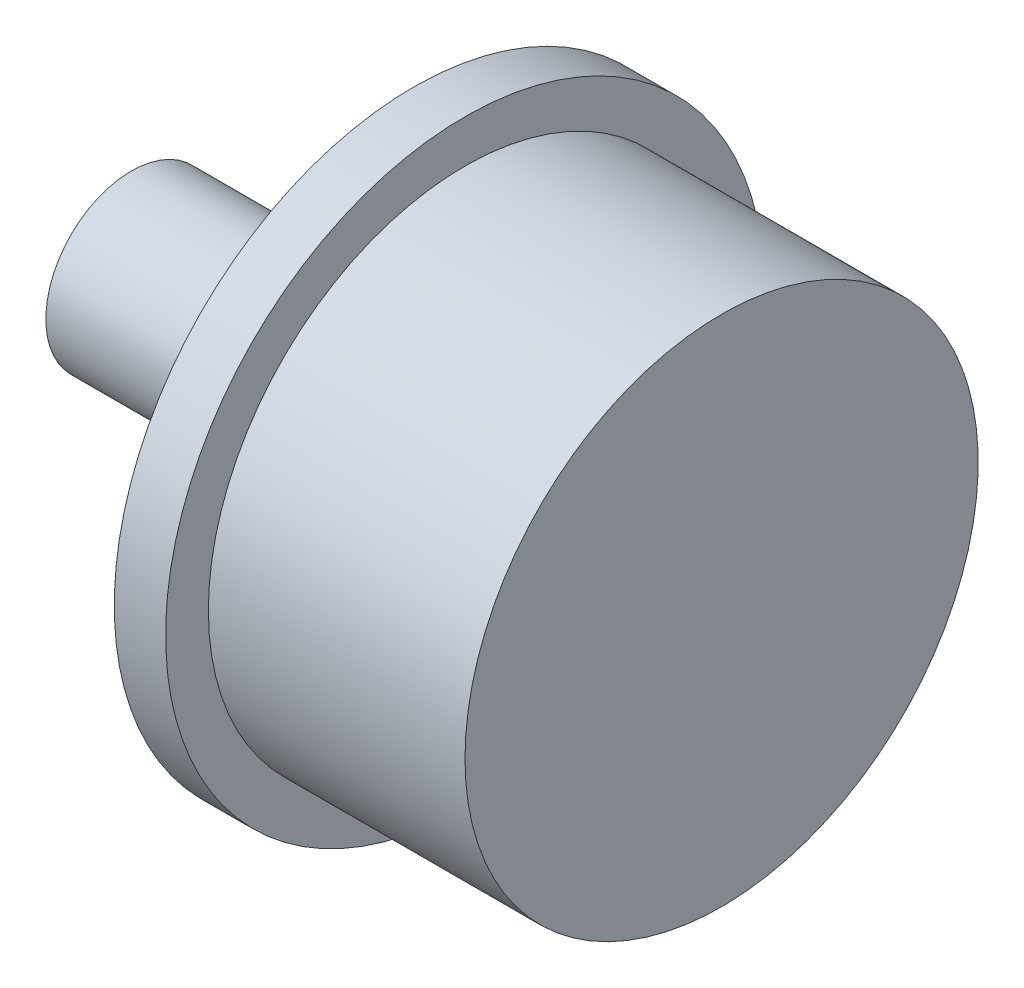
ISO-10303-21;
HEADER;
FILE_DESCRIPTION(('STEP AP214'),'2;1');
FILE_NAME('part.step','',(''),(''),'','','');
FILE_SCHEMA(('AUTOMOTIVE_DESIGN { 1 0 10303 214 1 1 1 1 }'));
ENDSEC;
DATA;
#1=APPLICATION_CONTEXT('core data for automotive mechanical design processes');
#2=APPLICATION_PROTOCOL_DEFINITION('international standard','automotive_design',2000,#1);
#3=PRODUCT_CONTEXT('',#1,'mechanical');
#4=PRODUCT('Part','Part','',(#3));
#5=PRODUCT_RELATED_PRODUCT_CATEGORY('part','',(#4));
#6=PRODUCT_DEFINITION_FORMATION('','',#4);
#7=PRODUCT_DEFINITION_CONTEXT('part definition',#1,'design');
#8=PRODUCT_DEFINITION('design','',#6,#7);
#9=PRODUCT_DEFINITION_SHAPE('','',#8);
#10=(LENGTH_UNIT() NAMED_UNIT(*) SI_UNIT(.MILLI.,.METRE.));
#11=(NAMED_UNIT(*) PLANE_ANGLE_UNIT() SI_UNIT($,.RADIAN.));
#12=(NAMED_UNIT(*) SI_UNIT($,.STERADIAN.) SOLID_ANGLE_UNIT());
#13=UNCERTAINTY_MEASURE_WITH_UNIT(LENGTH_MEASURE(1.E-05),#10,'distance_accuracy_value','');
#14=(GEOMETRIC_REPRESENTATION_CONTEXT(3) GLOBAL_UNCERTAINTY_ASSIGNED_CONTEXT((#13)) GLOBAL_UNIT_ASSIGNED_CONTEXT((#10,
#11,#12)) REPRESENTATION_CONTEXT('',''));
#15=CARTESIAN_POINT('',(0.,0.,0.));
#16=DIRECTION('',(0.,0.,1.));
#17=DIRECTION('',(1.,0.,0.));
#18=AXIS2_PLACEMENT_3D('',#15,#16,#17);
#19=CARTESIAN_POINT('',(-5.715,0.,0.));
#20=DIRECTION('',(-1.,0.,0.));
#21=DIRECTION('',(0.,0.,1.));
#22=AXIS2_PLACEMENT_3D('',#19,#20,#21);
#23=PLANE('',#22);
#24=CARTESIAN_POINT('',(-5.715,0.,0.));
#25=DIRECTION('',(-1.,0.,0.));
#26=DIRECTION('',(0.,0.,1.));
#27=AXIS2_PLACEMENT_3D('',#24,#25,#26);
#28=CIRCLE('',#27,7.62);
#29=CARTESIAN_POINT('',(-5.715,0.,-7.62));
#30=VERTEX_POINT('',#29);
#31=EDGE_CURVE('E54',#30,#30,#28,.T.);
#32=ORIENTED_EDGE('',*,*,#31,.T.);
#33=EDGE_LOOP('',(#32));
#34=FACE_BOUND('',#33,.T.);
#35=CARTESIAN_POINT('',(-5.715,0.,0.));
#36=DIRECTION('',(-1.,0.,0.));
#37=DIRECTION('',(0.,0.,1.));
#38=AXIS2_PLACEMENT_3D('',#35,#36,#37);
#39=CIRCLE('',#38,6.35);
#40=CARTESIAN_POINT('',(-5.715,0.,-6.35));
#41=VERTEX_POINT('',#40);
#42=EDGE_CURVE('E60',#41,#41,#39,.T.);
#43=ORIENTED_EDGE('',*,*,#42,.F.);
#44=EDGE_LOOP('',(#43));
#45=FACE_BOUND('',#44,.T.);
#46=ADVANCED_FACE('F33',(#34,#45),#23,.T.);
#47=CARTESIAN_POINT('',(-3.81,0.,0.));
#48=DIRECTION('',(1.,0.,0.));
#49=DIRECTION('',(0.,0.,-1.));
#50=AXIS2_PLACEMENT_3D('',#47,#48,#49);
#51=PLANE('',#50);
#52=CARTESIAN_POINT('',(-3.81,0.,0.));
#53=DIRECTION('',(1.,0.,0.));
#54=DIRECTION('',(0.,0.,-1.));
#55=AXIS2_PLACEMENT_3D('',#52,#53,#54);
#56=CIRCLE('',#55,22.225);
#57=CARTESIAN_POINT('',(-3.81,0.,-22.225));
#58=VERTEX_POINT('',#57);
#59=EDGE_CURVE('E40',#58,#58,#56,.T.);
#60=ORIENTED_EDGE('',*,*,#59,.F.);
#61=EDGE_LOOP('',(#60));
#62=FACE_BOUND('',#61,.T.);
#63=CARTESIAN_POINT('',(-3.81,0.,0.));
#64=DIRECTION('',(1.,0.,0.));
#65=DIRECTION('',(0.,0.,-1.));
#66=AXIS2_PLACEMENT_3D('',#63,#64,#65);
#67=CIRCLE('',#66,7.62);
#68=CARTESIAN_POINT('',(-3.81,0.,-7.62));
#69=VERTEX_POINT('',#68);
#70=EDGE_CURVE('E10',#69,#69,#67,.F.);
#71=ORIENTED_EDGE('',*,*,#70,.F.);
#72=EDGE_LOOP('',(#71));
#73=FACE_BOUND('',#72,.T.);
#74=ADVANCED_FACE('F76',(#62,#73),#51,.F.);
#75=CARTESIAN_POINT('',(0.,0.,0.));
#76=DIRECTION('',(1.,0.,0.));
#77=DIRECTION('',(0.,0.,-1.));
#78=AXIS2_PLACEMENT_3D('',#75,#76,#77);
#79=PLANE('',#78);
#80=CARTESIAN_POINT('',(0.,0.,0.));
#81=DIRECTION('',(1.,0.,0.));
#82=DIRECTION('',(0.,0.,-1.));
#83=AXIS2_PLACEMENT_3D('',#80,#81,#82);
#84=CIRCLE('',#83,22.225);
#85=CARTESIAN_POINT('',(0.,0.,-22.225));
#86=VERTEX_POINT('',#85);
#87=EDGE_CURVE('E44',#86,#86,#84,.T.);
#88=ORIENTED_EDGE('',*,*,#87,.T.);
#89=EDGE_LOOP('',(#88));
#90=FACE_BOUND('',#89,.T.);
#91=CARTESIAN_POINT('',(0.,0.,0.));
#92=DIRECTION('',(1.,0.,0.));
#93=DIRECTION('',(0.,0.,-1.));
#94=AXIS2_PLACEMENT_3D('',#91,#92,#93);
#95=CIRCLE('',#94,19.05);
#96=CARTESIAN_POINT('',(0.,0.,19.05));
#97=VERTEX_POINT('',#96);
#98=EDGE_CURVE('E51',#97,#97,#95,.T.);
#99=ORIENTED_EDGE('',*,*,#98,.F.);
#100=EDGE_LOOP('',(#99));
#101=FACE_BOUND('',#100,.T.);
#102=ADVANCED_FACE('F82',(#90,#101),#79,.T.);
#103=CARTESIAN_POINT('',(-3.81,0.,0.));
#104=DIRECTION('',(1.,0.,0.));
#105=DIRECTION('',(0.,0.,-1.));
#106=AXIS2_PLACEMENT_3D('',#103,#104,#105);
#107=CYLINDRICAL_SURFACE('',#106,22.225);
#108=CARTESIAN_POINT('',(-3.81,0.,-22.225));
#109=CARTESIAN_POINT('',(-3.7703125,0.,-22.225));
#110=CARTESIAN_POINT('',(-3.730625,0.,-22.225));
#111=CARTESIAN_POINT('',(-3.65125,0.,-22.225));
#112=CARTESIAN_POINT('',(-3.6115625,0.,-22.225));
#113=CARTESIAN_POINT('',(-3.5321875,0.,-22.225));
#114=CARTESIAN_POINT('',(-3.4925,0.,-22.225));
#115=CARTESIAN_POINT('',(-3.413125,0.,-22.225));
#116=CARTESIAN_POINT('',(-3.3734375,0.,-22.225));
#117=CARTESIAN_POINT('',(-3.2940625,0.,-22.225));
#118=CARTESIAN_POINT('',(-3.254375,0.,-22.225));
#119=CARTESIAN_POINT('',(-3.175,0.,-22.225));
#120=CARTESIAN_POINT('',(-3.1353125,0.,-22.225));
#121=CARTESIAN_POINT('',(-3.0559375,0.,-22.225));
#122=CARTESIAN_POINT('',(-3.01625,0.,-22.225));
#123=CARTESIAN_POINT('',(-2.936875,0.,-22.225));
#124=CARTESIAN_POINT('',(-2.8971875,0.,-22.225));
#125=CARTESIAN_POINT('',(-2.8178125,0.,-22.225));
#126=CARTESIAN_POINT('',(-2.778125,0.,-22.225));
#127=CARTESIAN_POINT('',(-2.69875,0.,-22.225));
#128=CARTESIAN_POINT('',(-2.6590625,0.,-22.225));
#129=CARTESIAN_POINT('',(-2.5796875,0.,-22.225));
#130=CARTESIAN_POINT('',(-2.54,0.,-22.225));
#131=CARTESIAN_POINT('',(-2.460625,0.,-22.225));
#132=CARTESIAN_POINT('',(-2.4209375,0.,-22.225));
#133=CARTESIAN_POINT('',(-2.3415625,0.,-22.225));
#134=CARTESIAN_POINT('',(-2.301875,0.,-22.225));
#135=CARTESIAN_POINT('',(-2.2225,0.,-22.225));
#136=CARTESIAN_POINT('',(-2.1828125,0.,-22.225));
#137=CARTESIAN_POINT('',(-2.1034375,0.,-22.225));
#138=CARTESIAN_POINT('',(-2.06375,0.,-22.225));
#139=CARTESIAN_POINT('',(-1.984375,0.,-22.225));
#140=CARTESIAN_POINT('',(-1.9446875,0.,-22.225));
#141=CARTESIAN_POINT('',(-1.8653125,0.,-22.225));
#142=CARTESIAN_POINT('',(-1.825625,0.,-22.225));
#143=CARTESIAN_POINT('',(-1.74625,0.,-22.225));
#144=CARTESIAN_POINT('',(-1.7065625,0.,-22.225));
#145=CARTESIAN_POINT('',(-1.6271875,0.,-22.225));
#146=CARTESIAN_POINT('',(-1.5875,0.,-22.225));
#147=CARTESIAN_POINT('',(-1.508125,0.,-22.225));
#148=CARTESIAN_POINT('',(-1.4684375,0.,-22.225));
#149=CARTESIAN_POINT('',(-1.3890625,0.,-22.225));
#150=CARTESIAN_POINT('',(-1.349375,0.,-22.225));
#151=CARTESIAN_POINT('',(-1.27,0.,-22.225));
#152=CARTESIAN_POINT('',(-1.2303125,0.,-22.225));
#153=CARTESIAN_POINT('',(-1.1509375,0.,-22.225));
#154=CARTESIAN_POINT('',(-1.11125,0.,-22.225));
#155=CARTESIAN_POINT('',(-1.031875,0.,-22.225));
#156=CARTESIAN_POINT('',(-0.9921875,0.,-22.225));
#157=CARTESIAN_POINT('',(-0.9128125,0.,-22.225));
#158=CARTESIAN_POINT('',(-0.873125,0.,-22.225));
#159=CARTESIAN_POINT('',(-0.79375,0.,-22.225));
#160=CARTESIAN_POINT('',(-0.7540625,0.,-22.225));
#161=CARTESIAN_POINT('',(-0.6746875,0.,-22.225));
#162=CARTESIAN_POINT('',(-0.635,0.,-22.225));
#163=CARTESIAN_POINT('',(-0.555625,0.,-22.225));
#164=CARTESIAN_POINT('',(-0.5159375,0.,-22.225));
#165=CARTESIAN_POINT('',(-0.4365625,0.,-22.225));
#166=CARTESIAN_POINT('',(-0.396875,0.,-22.225));
#167=CARTESIAN_POINT('',(-0.3175,0.,-22.225));
#168=CARTESIAN_POINT('',(-0.2778125,0.,-22.225));
#169=CARTESIAN_POINT('',(-0.1984375,0.,-22.225));
#170=CARTESIAN_POINT('',(-0.15875,0.,-22.225));
#171=CARTESIAN_POINT('',(-0.0793749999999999,0.,-22.225));
#172=CARTESIAN_POINT('',(-0.0396874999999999,0.,-22.225));
#173=CARTESIAN_POINT('',(0.,0.,-22.225));
#174=B_SPLINE_CURVE_WITH_KNOTS('',3,(#108,#109,#110,#111,#112,#113,#114,#115,#116,#117,#118,
#119,#120,#121,#122,#123,#124,#125,#126,#127,#128,#129,#130,#131,#132,#133,#134,#135,#136,#137,
#138,#139,#140,#141,#142,#143,#144,#145,#146,#147,#148,#149,#150,#151,#152,#153,#154,#155,#156,
#157,#158,#159,#160,#161,#162,#163,#164,#165,#166,#167,#168,#169,#170,#171,#172,#173),
.UNSPECIFIED.,.F.,.F.,(4,2,2,2,2,2,2,2,2,2,2,2,2,2,2,2,2,2,2,2,2,2,2,2,2,2,2,2,2,2,2,2,4),(0.,
0.1190625,0.238125,0.3571875,0.47625,0.5953125,0.714375,0.833437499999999,0.9525,1.0715625,
1.190625,1.3096875,1.42875,1.5478125,1.666875,1.7859375,1.905,2.0240625,2.143125,2.2621875,
2.38125,2.5003125,2.619375,2.7384375,2.8575,2.9765625,3.095625,3.2146875,3.33375,3.4528125,
3.571875,3.6909375,3.81),.UNSPECIFIED.);
#175=EDGE_CURVE('BSEAM35',#58,#86,#174,.T.);
#176=ORIENTED_EDGE('',*,*,#59,.T.);
#177=ORIENTED_EDGE('',*,*,#87,.F.);
#178=ORIENTED_EDGE('',*,*,#175,.T.);
#179=ORIENTED_EDGE('',*,*,#175,.F.);
#180=EDGE_LOOP('',(#176,#178,#177,#179));
#181=FACE_BOUND('',#180,.T.);
#182=ADVANCED_FACE('F35',(#181),#107,.T.);
#183=CARTESIAN_POINT('',(19.05,0.,0.));
#184=DIRECTION('',(-1.,0.,0.));
#185=DIRECTION('',(0.,0.,1.));
#186=AXIS2_PLACEMENT_3D('',#183,#184,#185);
#187=CYLINDRICAL_SURFACE('',#186,19.05);
#188=CARTESIAN_POINT('',(19.05,0.,0.));
#189=DIRECTION('',(1.,0.,0.));
#190=DIRECTION('',(0.,0.,-1.));
#191=AXIS2_PLACEMENT_3D('',#188,#189,#190);
#192=CIRCLE('',#191,19.05);
#193=CARTESIAN_POINT('',(19.05,0.,19.05));
#194=VERTEX_POINT('',#193);
#195=EDGE_CURVE('E49',#194,#194,#192,.T.);
#196=CARTESIAN_POINT('',(19.05,0.,19.05));
#197=CARTESIAN_POINT('',(18.8515625,0.,19.05));
#198=CARTESIAN_POINT('',(18.653125,0.,19.05));
#199=CARTESIAN_POINT('',(18.25625,0.,19.05));
#200=CARTESIAN_POINT('',(18.0578125,0.,19.05));
#201=CARTESIAN_POINT('',(17.6609375,0.,19.05));
#202=CARTESIAN_POINT('',(17.4625,0.,19.05));
#203=CARTESIAN_POINT('',(17.065625,0.,19.05));
#204=CARTESIAN_POINT('',(16.8671875,0.,19.05));
#205=CARTESIAN_POINT('',(16.4703125,0.,19.05));
#206=CARTESIAN_POINT('',(16.271875,0.,19.05));
#207=CARTESIAN_POINT('',(15.875,0.,19.05));
#208=CARTESIAN_POINT('',(15.6765625,0.,19.05));
#209=CARTESIAN_POINT('',(15.2796875,0.,19.05));
#210=CARTESIAN_POINT('',(15.08125,0.,19.05));
#211=CARTESIAN_POINT('',(14.684375,0.,19.05));
#212=CARTESIAN_POINT('',(14.4859375,0.,19.05));
#213=CARTESIAN_POINT('',(14.0890625,0.,19.05));
#214=CARTESIAN_POINT('',(13.890625,0.,19.05));
#215=CARTESIAN_POINT('',(13.49375,0.,19.05));
#216=CARTESIAN_POINT('',(13.2953125,0.,19.05));
#217=CARTESIAN_POINT('',(12.8984375,0.,19.05));
#218=CARTESIAN_POINT('',(12.7,0.,19.05));
#219=CARTESIAN_POINT('',(12.303125,0.,19.05));
#220=CARTESIAN_POINT('',(12.1046875,0.,19.05));
#221=CARTESIAN_POINT('',(11.7078125,0.,19.05));
#222=CARTESIAN_POINT('',(11.509375,0.,19.05));
#223=CARTESIAN_POINT('',(11.1125,0.,19.05));
#224=CARTESIAN_POINT('',(10.9140625,0.,19.05));
#225=CARTESIAN_POINT('',(10.5171875,0.,19.05));
#226=CARTESIAN_POINT('',(10.31875,0.,19.05));
#227=CARTESIAN_POINT('',(9.921875,0.,19.05));
#228=CARTESIAN_POINT('',(9.7234375,0.,19.05));
#229=CARTESIAN_POINT('',(9.3265625,0.,19.05));
#230=CARTESIAN_POINT('',(9.128125,0.,19.05));
#231=CARTESIAN_POINT('',(8.73125,0.,19.05));
#232=CARTESIAN_POINT('',(8.5328125,0.,19.05));
#233=CARTESIAN_POINT('',(8.1359375,0.,19.05));
#234=CARTESIAN_POINT('',(7.9375,0.,19.05));
#235=CARTESIAN_POINT('',(7.540625,0.,19.05));
#236=CARTESIAN_POINT('',(7.3421875,0.,19.05));
#237=CARTESIAN_POINT('',(6.9453125,0.,19.05));
#238=CARTESIAN_POINT('',(6.746875,0.,19.05));
#239=CARTESIAN_POINT('',(6.35,0.,19.05));
#240=CARTESIAN_POINT('',(6.1515625,0.,19.05));
#241=CARTESIAN_POINT('',(5.7546875,0.,19.05));
#242=CARTESIAN_POINT('',(5.55625,0.,19.05));
#243=CARTESIAN_POINT('',(5.159375,0.,19.05));
#244=CARTESIAN_POINT('',(4.9609375,0.,19.05));
#245=CARTESIAN_POINT('',(4.5640625,0.,19.05));
#246=CARTESIAN_POINT('',(4.365625,0.,19.05));
#247=CARTESIAN_POINT('',(3.96875,0.,19.05));
#248=CARTESIAN_POINT('',(3.7703125,0.,19.05));
#249=CARTESIAN_POINT('',(3.3734375,0.,19.05));
#250=CARTESIAN_POINT('',(3.175,0.,19.05));
#251=CARTESIAN_POINT('',(2.778125,0.,19.05));
#252=CARTESIAN_POINT('',(2.5796875,0.,19.05));
#253=CARTESIAN_POINT('',(2.1828125,0.,19.05));
#254=CARTESIAN_POINT('',(1.984375,0.,19.05));
#255=CARTESIAN_POINT('',(1.5875,0.,19.05));
#256=CARTESIAN_POINT('',(1.3890625,0.,19.05));
#257=CARTESIAN_POINT('',(0.992187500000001,0.,19.05));
#258=CARTESIAN_POINT('',(0.793750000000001,0.,19.05));
#259=CARTESIAN_POINT('',(0.396875,0.,19.05));
#260=CARTESIAN_POINT('',(0.1984375,0.,19.05));
#261=CARTESIAN_POINT('',(0.,0.,19.05));
#262=B_SPLINE_CURVE_WITH_KNOTS('',3,(#196,#197,#198,#199,#200,#201,#202,#203,#204,#205,#206,
#207,#208,#209,#210,#211,#212,#213,#214,#215,#216,#217,#218,#219,#220,#221,#222,#223,#224,#225,
#226,#227,#228,#229,#230,#231,#232,#233,#234,#235,#236,#237,#238,#239,#240,#241,#242,#243,#244,
#245,#246,#247,#248,#249,#250,#251,#252,#253,#254,#255,#256,#257,#258,#259,#260,#261),
.UNSPECIFIED.,.F.,.F.,(4,2,2,2,2,2,2,2,2,2,2,2,2,2,2,2,2,2,2,2,2,2,2,2,2,2,2,2,2,2,2,2,4),(0.,
0.5953125,1.190625,1.7859375,2.38125,2.9765625,3.571875,4.1671875,4.7625,5.3578125,5.953125,
6.5484375,7.14375,7.7390625,8.334375,8.9296875,9.525,10.1203125,10.715625,11.3109375,11.90625,
12.5015625,13.096875,13.6921875,14.2875,14.8828125,15.478125,16.0734375,16.66875,17.2640625,
17.859375,18.4546875,19.05),.UNSPECIFIED.);
#263=EDGE_CURVE('BSEAM93',#194,#97,#262,.T.);
#264=ORIENTED_EDGE('',*,*,#195,.F.);
#265=ORIENTED_EDGE('',*,*,#98,.T.);
#266=ORIENTED_EDGE('',*,*,#263,.T.);
#267=ORIENTED_EDGE('',*,*,#263,.F.);
#268=EDGE_LOOP('',(#264,#266,#265,#267));
#269=FACE_BOUND('',#268,.T.);
#270=ADVANCED_FACE('F93',(#269),#187,.T.);
#271=CARTESIAN_POINT('',(19.05,0.,0.));
#272=DIRECTION('',(1.,0.,0.));
#273=DIRECTION('',(0.,0.,-1.));
#274=AXIS2_PLACEMENT_3D('',#271,#272,#273);
#275=PLANE('',#274);
#276=ORIENTED_EDGE('',*,*,#195,.T.);
#277=EDGE_LOOP('',(#276));
#278=FACE_BOUND('',#277,.T.);
#279=ADVANCED_FACE('F89',(#278),#275,.T.);
#280=CARTESIAN_POINT('',(-5.715,0.,0.));
#281=DIRECTION('',(1.,0.,0.));
#282=DIRECTION('',(0.,0.,-1.));
#283=AXIS2_PLACEMENT_3D('',#280,#281,#282);
#284=CYLINDRICAL_SURFACE('',#283,7.62);
#285=CARTESIAN_POINT('',(-5.715,0.,-7.62));
#286=CARTESIAN_POINT('',(-5.69515625,0.,-7.62));
#287=CARTESIAN_POINT('',(-5.6753125,0.,-7.62));
#288=CARTESIAN_POINT('',(-5.635625,0.,-7.62));
#289=CARTESIAN_POINT('',(-5.61578125,0.,-7.62));
#290=CARTESIAN_POINT('',(-5.57609375,0.,-7.62));
#291=CARTESIAN_POINT('',(-5.55625,0.,-7.62));
#292=CARTESIAN_POINT('',(-5.5165625,0.,-7.62));
#293=CARTESIAN_POINT('',(-5.49671875,0.,-7.62));
#294=CARTESIAN_POINT('',(-5.45703125,0.,-7.62));
#295=CARTESIAN_POINT('',(-5.4371875,0.,-7.62));
#296=CARTESIAN_POINT('',(-5.3975,0.,-7.62));
#297=CARTESIAN_POINT('',(-5.37765625,0.,-7.62));
#298=CARTESIAN_POINT('',(-5.33796875,0.,-7.62));
#299=CARTESIAN_POINT('',(-5.318125,0.,-7.62));
#300=CARTESIAN_POINT('',(-5.2784375,0.,-7.62));
#301=CARTESIAN_POINT('',(-5.25859375,0.,-7.62));
#302=CARTESIAN_POINT('',(-5.21890625,0.,-7.62));
#303=CARTESIAN_POINT('',(-5.1990625,0.,-7.62));
#304=CARTESIAN_POINT('',(-5.159375,0.,-7.62));
#305=CARTESIAN_POINT('',(-5.13953125,0.,-7.62));
#306=CARTESIAN_POINT('',(-5.09984375,0.,-7.62));
#307=CARTESIAN_POINT('',(-5.08,0.,-7.62));
#308=CARTESIAN_POINT('',(-5.0403125,0.,-7.62));
#309=CARTESIAN_POINT('',(-5.02046875,0.,-7.62));
#310=CARTESIAN_POINT('',(-4.98078125,0.,-7.62));
#311=CARTESIAN_POINT('',(-4.9609375,0.,-7.62));
#312=CARTESIAN_POINT('',(-4.92125,0.,-7.62));
#313=CARTESIAN_POINT('',(-4.90140625,0.,-7.62));
#314=CARTESIAN_POINT('',(-4.86171875,0.,-7.62));
#315=CARTESIAN_POINT('',(-4.841875,0.,-7.62));
#316=CARTESIAN_POINT('',(-4.8021875,0.,-7.62));
#317=CARTESIAN_POINT('',(-4.78234375,0.,-7.62));
#318=CARTESIAN_POINT('',(-4.74265625,0.,-7.62));
#319=CARTESIAN_POINT('',(-4.7228125,0.,-7.62));
#320=CARTESIAN_POINT('',(-4.683125,0.,-7.62));
#321=CARTESIAN_POINT('',(-4.66328125,0.,-7.62));
#322=CARTESIAN_POINT('',(-4.62359375,0.,-7.62));
#323=CARTESIAN_POINT('',(-4.60375,0.,-7.62));
#324=CARTESIAN_POINT('',(-4.5640625,0.,-7.62));
#325=CARTESIAN_POINT('',(-4.54421875,0.,-7.62));
#326=CARTESIAN_POINT('',(-4.50453125,0.,-7.62));
#327=CARTESIAN_POINT('',(-4.4846875,0.,-7.62));
#328=CARTESIAN_POINT('',(-4.445,0.,-7.62));
#329=CARTESIAN_POINT('',(-4.42515625,0.,-7.62));
#330=CARTESIAN_POINT('',(-4.38546875,0.,-7.62));
#331=CARTESIAN_POINT('',(-4.365625,0.,-7.62));
#332=CARTESIAN_POINT('',(-4.3259375,0.,-7.62));
#333=CARTESIAN_POINT('',(-4.30609375,0.,-7.62));
#334=CARTESIAN_POINT('',(-4.26640625,0.,-7.62));
#335=CARTESIAN_POINT('',(-4.2465625,0.,-7.62));
#336=CARTESIAN_POINT('',(-4.206875,0.,-7.62));
#337=CARTESIAN_POINT('',(-4.18703125,0.,-7.62));
#338=CARTESIAN_POINT('',(-4.14734375,0.,-7.62));
#339=CARTESIAN_POINT('',(-4.1275,0.,-7.62));
#340=CARTESIAN_POINT('',(-4.0878125,0.,-7.62));
#341=CARTESIAN_POINT('',(-4.06796875,0.,-7.62));
#342=CARTESIAN_POINT('',(-4.02828125,0.,-7.62));
#343=CARTESIAN_POINT('',(-4.0084375,0.,-7.62));
#344=CARTESIAN_POINT('',(-3.96875,0.,-7.62));
#345=CARTESIAN_POINT('',(-3.94890625,0.,-7.62));
#346=CARTESIAN_POINT('',(-3.90921875,0.,-7.62));
#347=CARTESIAN_POINT('',(-3.889375,0.,-7.62));
#348=CARTESIAN_POINT('',(-3.8496875,0.,-7.62));
#349=CARTESIAN_POINT('',(-3.82984375,0.,-7.62));
#350=CARTESIAN_POINT('',(-3.81,0.,-7.62));
#351=B_SPLINE_CURVE_WITH_KNOTS('',3,(#285,#286,#287,#288,#289,#290,#291,#292,#293,#294,#295,
#296,#297,#298,#299,#300,#301,#302,#303,#304,#305,#306,#307,#308,#309,#310,#311,#312,#313,#314,
#315,#316,#317,#318,#319,#320,#321,#322,#323,#324,#325,#326,#327,#328,#329,#330,#331,#332,#333,
#334,#335,#336,#337,#338,#339,#340,#341,#342,#343,#344,#345,#346,#347,#348,#349,#350),
.UNSPECIFIED.,.F.,.F.,(4,2,2,2,2,2,2,2,2,2,2,2,2,2,2,2,2,2,2,2,2,2,2,2,2,2,2,2,2,2,2,2,4),(0.,
0.0595312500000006,0.1190625,0.178593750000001,0.238125,0.29765625,0.3571875,0.41671875,0.47625,
0.535781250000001,0.5953125,0.65484375,0.714375,0.77390625,0.8334375,0.892968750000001,0.9525,
1.01203125,1.0715625,1.13109375,1.190625,1.25015625,1.3096875,1.36921875,1.42875,1.48828125,
1.5478125,1.60734375,1.666875,1.72640625,1.7859375,1.84546875,1.905),.UNSPECIFIED.);
#352=EDGE_CURVE('BSEAM71',#30,#69,#351,.T.);
#353=ORIENTED_EDGE('',*,*,#31,.F.);
#354=ORIENTED_EDGE('',*,*,#70,.T.);
#355=ORIENTED_EDGE('',*,*,#352,.T.);
#356=ORIENTED_EDGE('',*,*,#352,.F.);
#357=EDGE_LOOP('',(#353,#355,#354,#356));
#358=FACE_BOUND('',#357,.T.);
#359=ADVANCED_FACE('F71',(#358),#284,.T.);
#360=CARTESIAN_POINT('',(-24.765,0.,0.));
#361=DIRECTION('',(1.,0.,0.));
#362=DIRECTION('',(0.,0.,-1.));
#363=AXIS2_PLACEMENT_3D('',#360,#361,#362);
#364=CYLINDRICAL_SURFACE('',#363,6.35);
#365=CARTESIAN_POINT('',(-24.765,0.,0.));
#366=DIRECTION('',(-1.,0.,0.));
#367=DIRECTION('',(0.,0.,1.));
#368=AXIS2_PLACEMENT_3D('',#365,#366,#367);
#369=CIRCLE('',#368,6.35);
#370=CARTESIAN_POINT('',(-24.765,0.,-6.35));
#371=VERTEX_POINT('',#370);
#372=EDGE_CURVE('E59',#371,#371,#369,.T.);
#373=CARTESIAN_POINT('',(-24.765,0.,-6.35));
#374=CARTESIAN_POINT('',(-24.5665625,0.,-6.35));
#375=CARTESIAN_POINT('',(-24.368125,0.,-6.35));
#376=CARTESIAN_POINT('',(-23.97125,0.,-6.35));
#377=CARTESIAN_POINT('',(-23.7728125,0.,-6.35));
#378=CARTESIAN_POINT('',(-23.3759375,0.,-6.35));
#379=CARTESIAN_POINT('',(-23.1775,0.,-6.35));
#380=CARTESIAN_POINT('',(-22.780625,0.,-6.35));
#381=CARTESIAN_POINT('',(-22.5821875,0.,-6.35));
#382=CARTESIAN_POINT('',(-22.1853125,0.,-6.35));
#383=CARTESIAN_POINT('',(-21.986875,0.,-6.35));
#384=CARTESIAN_POINT('',(-21.59,0.,-6.35));
#385=CARTESIAN_POINT('',(-21.3915625,0.,-6.35));
#386=CARTESIAN_POINT('',(-20.9946875,0.,-6.35));
#387=CARTESIAN_POINT('',(-20.79625,0.,-6.35));
#388=CARTESIAN_POINT('',(-20.399375,0.,-6.35));
#389=CARTESIAN_POINT('',(-20.2009375,0.,-6.35));
#390=CARTESIAN_POINT('',(-19.8040625,0.,-6.35));
#391=CARTESIAN_POINT('',(-19.605625,0.,-6.35));
#392=CARTESIAN_POINT('',(-19.20875,0.,-6.35));
#393=CARTESIAN_POINT('',(-19.0103125,0.,-6.35));
#394=CARTESIAN_POINT('',(-18.6134375,0.,-6.35));
#395=CARTESIAN_POINT('',(-18.415,0.,-6.35));
#396=CARTESIAN_POINT('',(-18.018125,0.,-6.35));
#397=CARTESIAN_POINT('',(-17.8196875,0.,-6.35));
#398=CARTESIAN_POINT('',(-17.4228125,0.,-6.35));
#399=CARTESIAN_POINT('',(-17.224375,0.,-6.35));
#400=CARTESIAN_POINT('',(-16.8275,0.,-6.35));
#401=CARTESIAN_POINT('',(-16.6290625,0.,-6.35));
#402=CARTESIAN_POINT('',(-16.2321875,0.,-6.35));
#403=CARTESIAN_POINT('',(-16.03375,0.,-6.35));
#404=CARTESIAN_POINT('',(-15.636875,0.,-6.35));
#405=CARTESIAN_POINT('',(-15.4384375,0.,-6.35));
#406=CARTESIAN_POINT('',(-15.0415625,0.,-6.35));
#407=CARTESIAN_POINT('',(-14.843125,0.,-6.35));
#408=CARTESIAN_POINT('',(-14.44625,0.,-6.35));
#409=CARTESIAN_POINT('',(-14.2478125,0.,-6.35));
#410=CARTESIAN_POINT('',(-13.8509375,0.,-6.35));
#411=CARTESIAN_POINT('',(-13.6525,0.,-6.35));
#412=CARTESIAN_POINT('',(-13.255625,0.,-6.35));
#413=CARTESIAN_POINT('',(-13.0571875,0.,-6.35));
#414=CARTESIAN_POINT('',(-12.6603125,0.,-6.35));
#415=CARTESIAN_POINT('',(-12.461875,0.,-6.35));
#416=CARTESIAN_POINT('',(-12.065,0.,-6.35));
#417=CARTESIAN_POINT('',(-11.8665625,0.,-6.35));
#418=CARTESIAN_POINT('',(-11.4696875,0.,-6.35));
#419=CARTESIAN_POINT('',(-11.27125,0.,-6.35));
#420=CARTESIAN_POINT('',(-10.874375,0.,-6.35));
#421=CARTESIAN_POINT('',(-10.6759375,0.,-6.35));
#422=CARTESIAN_POINT('',(-10.2790625,0.,-6.35));
#423=CARTESIAN_POINT('',(-10.080625,0.,-6.35));
#424=CARTESIAN_POINT('',(-9.68375,0.,-6.35));
#425=CARTESIAN_POINT('',(-9.4853125,0.,-6.35));
#426=CARTESIAN_POINT('',(-9.0884375,0.,-6.35));
#427=CARTESIAN_POINT('',(-8.89,0.,-6.35));
#428=CARTESIAN_POINT('',(-8.493125,0.,-6.35));
#429=CARTESIAN_POINT('',(-8.2946875,0.,-6.35));
#430=CARTESIAN_POINT('',(-7.8978125,0.,-6.35));
#431=CARTESIAN_POINT('',(-7.699375,0.,-6.35));
#432=CARTESIAN_POINT('',(-7.3025,0.,-6.35));
#433=CARTESIAN_POINT('',(-7.1040625,0.,-6.35));
#434=CARTESIAN_POINT('',(-6.7071875,0.,-6.35));
#435=CARTESIAN_POINT('',(-6.50875,0.,-6.35));
#436=CARTESIAN_POINT('',(-6.111875,0.,-6.35));
#437=CARTESIAN_POINT('',(-5.9134375,0.,-6.35));
#438=CARTESIAN_POINT('',(-5.715,0.,-6.35));
#439=B_SPLINE_CURVE_WITH_KNOTS('',3,(#373,#374,#375,#376,#377,#378,#379,#380,#381,#382,#383,
#384,#385,#386,#387,#388,#389,#390,#391,#392,#393,#394,#395,#396,#397,#398,#399,#400,#401,#402,
#403,#404,#405,#406,#407,#408,#409,#410,#411,#412,#413,#414,#415,#416,#417,#418,#419,#420,#421,
#422,#423,#424,#425,#426,#427,#428,#429,#430,#431,#432,#433,#434,#435,#436,#437,#438),
.UNSPECIFIED.,.F.,.F.,(4,2,2,2,2,2,2,2,2,2,2,2,2,2,2,2,2,2,2,2,2,2,2,2,2,2,2,2,2,2,2,2,4),(0.,
0.595312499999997,1.190625,1.7859375,2.38125,2.9765625,3.571875,4.1671875,4.7625,5.3578125,
5.953125,6.5484375,7.14375,7.7390625,8.33437499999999,8.92968749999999,9.525,10.1203125,
10.715625,11.3109375,11.90625,12.5015625,13.096875,13.6921875,14.2875,14.8828125,15.478125,
16.0734375,16.66875,17.2640625,17.859375,18.4546875,19.05),.UNSPECIFIED.);
#440=EDGE_CURVE('BSEAM68',#371,#41,#439,.T.);
#441=ORIENTED_EDGE('',*,*,#372,.F.);
#442=ORIENTED_EDGE('',*,*,#42,.T.);
#443=ORIENTED_EDGE('',*,*,#440,.T.);
#444=ORIENTED_EDGE('',*,*,#440,.F.);
#445=EDGE_LOOP('',(#441,#443,#442,#444));
#446=FACE_BOUND('',#445,.T.);
#447=ADVANCED_FACE('F68',(#446),#364,.T.);
#448=CARTESIAN_POINT('',(-24.765,0.,0.));
#449=DIRECTION('',(-1.,0.,0.));
#450=DIRECTION('',(0.,0.,1.));
#451=AXIS2_PLACEMENT_3D('',#448,#449,#450);
#452=PLANE('',#451);
#453=ORIENTED_EDGE('',*,*,#372,.T.);
#454=EDGE_LOOP('',(#453));
#455=FACE_BOUND('',#454,.T.);
#456=ADVANCED_FACE('F66',(#455),#452,.T.);
#457=CLOSED_SHELL('',(#46,#74,#102,#182,#270,#279,#359,#447,#456));
#458=MANIFOLD_SOLID_BREP('B2',#457);
#459=ADVANCED_BREP_SHAPE_REPRESENTATION('',(#18,#458),#14);
#460=SHAPE_DEFINITION_REPRESENTATION(#9,#459);
ENDSEC;
END-ISO-10303-21;
